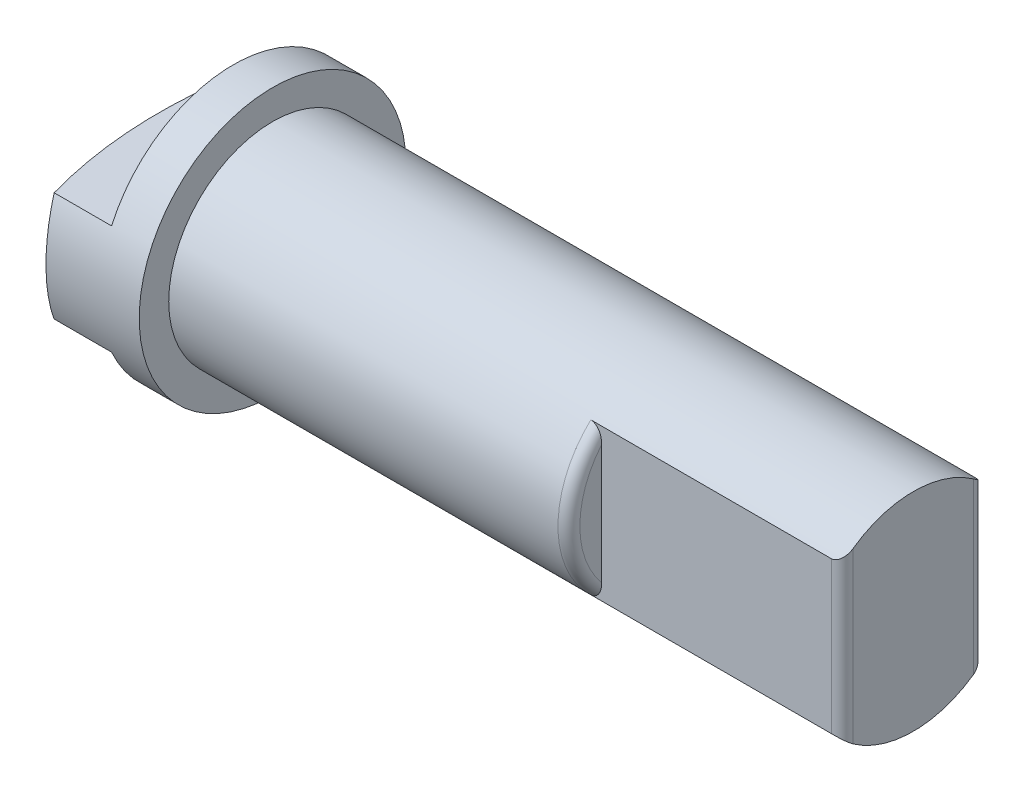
ISO-10303-21;
HEADER;
FILE_DESCRIPTION(('STEP AP214'),'2;1');
FILE_NAME('part.step','',(''),(''),'','','');
FILE_SCHEMA(('AUTOMOTIVE_DESIGN { 1 0 10303 214 1 1 1 1 }'));
ENDSEC;
DATA;
#1=APPLICATION_CONTEXT('core data for automotive mechanical design processes');
#2=APPLICATION_PROTOCOL_DEFINITION('international standard','automotive_design',2000,#1);
#3=PRODUCT_CONTEXT('',#1,'mechanical');
#4=PRODUCT('Part','Part','',(#3));
#5=PRODUCT_RELATED_PRODUCT_CATEGORY('part','',(#4));
#6=PRODUCT_DEFINITION_FORMATION('','',#4);
#7=PRODUCT_DEFINITION_CONTEXT('part definition',#1,'design');
#8=PRODUCT_DEFINITION('design','',#6,#7);
#9=PRODUCT_DEFINITION_SHAPE('','',#8);
#10=(LENGTH_UNIT() NAMED_UNIT(*) SI_UNIT(.MILLI.,.METRE.));
#11=(NAMED_UNIT(*) PLANE_ANGLE_UNIT() SI_UNIT($,.RADIAN.));
#12=(NAMED_UNIT(*) SI_UNIT($,.STERADIAN.) SOLID_ANGLE_UNIT());
#13=UNCERTAINTY_MEASURE_WITH_UNIT(LENGTH_MEASURE(1.E-05),#10,'distance_accuracy_value','');
#14=(GEOMETRIC_REPRESENTATION_CONTEXT(3) GLOBAL_UNCERTAINTY_ASSIGNED_CONTEXT((#13)) GLOBAL_UNIT_ASSIGNED_CONTEXT((#10,
#11,#12)) REPRESENTATION_CONTEXT('',''));
#15=CARTESIAN_POINT('',(0.,0.,0.));
#16=DIRECTION('',(0.,0.,1.));
#17=DIRECTION('',(1.,0.,0.));
#18=AXIS2_PLACEMENT_3D('',#15,#16,#17);
#19=CARTESIAN_POINT('',(3.39999999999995,-2.5,-10.5));
#20=DIRECTION('',(1.,0.,0.));
#21=DIRECTION('',(0.,0.,-1.));
#22=AXIS2_PLACEMENT_3D('',#19,#20,#21);
#23=PLANE('',#22);
#24=DIRECTION('',(0.,0.,1.));
#25=VECTOR('',#24,1.);
#26=CARTESIAN_POINT('',(3.39999999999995,-2.5,-10.5));
#27=LINE('',#26,#25);
#28=CARTESIAN_POINT('',(3.39999999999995,-2.5,5.56417109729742));
#29=VERTEX_POINT('',#28);
#30=CARTESIAN_POINT('',(3.39999999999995,-2.5,-5.56417109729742));
#31=VERTEX_POINT('',#30);
#32=EDGE_CURVE('E78',#29,#31,#27,.F.);
#33=ORIENTED_EDGE('',*,*,#32,.T.);
#34=CARTESIAN_POINT('',(3.39999999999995,0.,0.));
#35=DIRECTION('',(1.,0.,0.));
#36=DIRECTION('',(0.,0.,-1.));
#37=AXIS2_PLACEMENT_3D('',#34,#35,#36);
#38=CIRCLE('',#37,6.1);
#39=EDGE_CURVE('E92',#29,#31,#38,.T.);
#40=ORIENTED_EDGE('',*,*,#39,.F.);
#41=EDGE_LOOP('',(#33,#40));
#42=FACE_BOUND('',#41,.T.);
#43=ADVANCED_FACE('F17',(#42),#23,.F.);
#44=CARTESIAN_POINT('',(-5.40740411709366,-2.5,-10.5));
#45=DIRECTION('',(0.,1.,0.));
#46=DIRECTION('',(0.,0.,1.));
#47=AXIS2_PLACEMENT_3D('',#44,#45,#46);
#48=PLANE('',#47);
#49=DIRECTION('',(1.,0.,0.));
#50=VECTOR('',#49,1.);
#51=CARTESIAN_POINT('',(-20.5727236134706,-2.5,-5.56417109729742));
#52=LINE('',#51,#50);
#53=CARTESIAN_POINT('',(0.77615651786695,-2.5,-5.56417109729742));
#54=VERTEX_POINT('',#53);
#55=EDGE_CURVE('E71',#31,#54,#52,.F.);
#56=ORIENTED_EDGE('',*,*,#55,.F.);
#57=ORIENTED_EDGE('',*,*,#32,.F.);
#58=DIRECTION('',(1.,0.,0.));
#59=VECTOR('',#58,1.);
#60=CARTESIAN_POINT('',(-20.5727236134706,-2.5,5.56417109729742));
#61=LINE('',#60,#59);
#62=CARTESIAN_POINT('',(0.776156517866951,-2.5,5.56417109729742));
#63=VERTEX_POINT('',#62);
#64=EDGE_CURVE('E74',#63,#29,#61,.T.);
#65=ORIENTED_EDGE('',*,*,#64,.F.);
#66=CARTESIAN_POINT('',(20.3325091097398,-2.5,0.));
#67=DIRECTION('',(0.,-1.,0.));
#68=DIRECTION('',(0.,0.,-1.));
#69=AXIS2_PLACEMENT_3D('',#66,#67,#68);
#70=CIRCLE('',#69,20.3325091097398);
#71=EDGE_CURVE('E20',#54,#63,#70,.F.);
#72=ORIENTED_EDGE('',*,*,#71,.F.);
#73=EDGE_LOOP('',(#56,#57,#65,#72));
#74=FACE_BOUND('',#73,.T.);
#75=ADVANCED_FACE('F69',(#74),#48,.F.);
#76=CARTESIAN_POINT('',(20.3325091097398,-7.5,0.));
#77=DIRECTION('',(0.,-1.,0.));
#78=DIRECTION('',(0.,0.,-1.));
#79=AXIS2_PLACEMENT_3D('',#76,#77,#78);
#80=CYLINDRICAL_SURFACE('',#79,20.3325091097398);
#81=CARTESIAN_POINT('',(0.77615651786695,2.5,5.56417109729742));
#82=CARTESIAN_POINT('',(0.795362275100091,2.34988467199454,5.63163726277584));
#83=CARTESIAN_POINT('',(0.813207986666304,2.19687034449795,5.69306681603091));
#84=CARTESIAN_POINT('',(0.845734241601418,1.88605229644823,5.80344320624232));
#85=CARTESIAN_POINT('',(0.86041429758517,1.72824784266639,5.85238812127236));
#86=CARTESIAN_POINT('',(0.886149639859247,1.40900842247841,5.93733719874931));
#87=CARTESIAN_POINT('',(0.897207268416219,1.24757587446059,5.97334972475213));
#88=CARTESIAN_POINT('',(0.915381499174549,0.922117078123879,6.03216702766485));
#89=CARTESIAN_POINT('',(0.922498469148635,0.758091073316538,6.05497303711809));
#90=CARTESIAN_POINT('',(0.932582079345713,0.428313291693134,6.0872032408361));
#91=CARTESIAN_POINT('',(0.935541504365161,0.262559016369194,6.09660417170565));
#92=CARTESIAN_POINT('',(0.937195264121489,-0.0691853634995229,6.10186321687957));
#93=CARTESIAN_POINT('',(0.935889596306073,-0.235175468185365,6.09772132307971));
#94=CARTESIAN_POINT('',(0.929055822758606,-0.566037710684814,6.07594112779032));
#95=CARTESIAN_POINT('',(0.923531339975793,-0.730910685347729,6.05831440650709));
#96=CARTESIAN_POINT('',(0.908440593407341,-1.05844032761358,6.00975184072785));
#97=CARTESIAN_POINT('',(0.898875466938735,-1.22109760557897,5.97881974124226));
#98=CARTESIAN_POINT('',(0.873755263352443,-1.5744410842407,5.89661638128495));
#99=CARTESIAN_POINT('',(0.857397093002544,-1.76442711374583,5.84255969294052));
#100=CARTESIAN_POINT('',(0.820059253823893,-2.13765862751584,5.71658069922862));
#101=CARTESIAN_POINT('',(0.799085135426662,-2.32091190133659,5.64467983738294));
#102=CARTESIAN_POINT('',(0.776156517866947,-2.5,5.56417109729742));
#103=B_SPLINE_CURVE_WITH_KNOTS('',3,(#81,#82,#83,#84,#85,#86,#87,#88,#89,#90,#91,#92,#93,#94,
#95,#96,#97,#98,#99,#100,#101,#102),.UNSPECIFIED.,.F.,.F.,(4,2,2,2,2,2,2,2,2,2,4),(0.,
0.496965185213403,0.994006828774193,1.49072644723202,1.98739970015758,2.48493384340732,
2.98246828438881,3.47957594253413,3.9765437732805,4.57014972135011,5.16304575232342),.UNSPECIFIED.);
#104=CARTESIAN_POINT('',(0.776156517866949,2.5,5.56417109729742));
#105=VERTEX_POINT('',#104);
#106=EDGE_CURVE('E99',#105,#63,#103,.T.);
#107=ORIENTED_EDGE('',*,*,#106,.F.);
#108=CARTESIAN_POINT('',(20.3325091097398,2.5,0.));
#109=DIRECTION('',(0.,-1.,0.));
#110=DIRECTION('',(0.,0.,-1.));
#111=AXIS2_PLACEMENT_3D('',#108,#109,#110);
#112=CIRCLE('',#111,20.3325091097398);
#113=CARTESIAN_POINT('',(0.776156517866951,2.5,-5.56417109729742));
#114=VERTEX_POINT('',#113);
#115=EDGE_CURVE('E83',#105,#114,#112,.T.);
#116=ORIENTED_EDGE('',*,*,#115,.T.);
#117=CARTESIAN_POINT('',(0.776156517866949,-2.5,-5.56417109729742));
#118=CARTESIAN_POINT('',(0.795362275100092,-2.34988467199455,-5.63163726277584));
#119=CARTESIAN_POINT('',(0.813207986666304,-2.19687034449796,-5.69306681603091));
#120=CARTESIAN_POINT('',(0.845734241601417,-1.88605229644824,-5.80344320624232));
#121=CARTESIAN_POINT('',(0.860414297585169,-1.72824784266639,-5.85238812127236));
#122=CARTESIAN_POINT('',(0.886149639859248,-1.40900842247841,-5.93733719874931));
#123=CARTESIAN_POINT('',(0.897207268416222,-1.24757587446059,-5.97334972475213));
#124=CARTESIAN_POINT('',(0.915381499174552,-0.922117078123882,-6.03216702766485));
#125=CARTESIAN_POINT('',(0.922498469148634,-0.758091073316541,-6.05497303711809));
#126=CARTESIAN_POINT('',(0.932582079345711,-0.428313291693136,-6.0872032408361));
#127=CARTESIAN_POINT('',(0.935541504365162,-0.262559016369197,-6.09660417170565));
#128=CARTESIAN_POINT('',(0.93719526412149,0.06918536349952,-6.10186321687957));
#129=CARTESIAN_POINT('',(0.935889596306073,0.235175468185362,-6.09772132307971));
#130=CARTESIAN_POINT('',(0.929055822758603,0.56603771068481,-6.07594112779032));
#131=CARTESIAN_POINT('',(0.923531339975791,0.730910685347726,-6.05831440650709));
#132=CARTESIAN_POINT('',(0.908440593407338,1.05844032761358,-6.00975184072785));
#133=CARTESIAN_POINT('',(0.898875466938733,1.22109760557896,-5.97881974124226));
#134=CARTESIAN_POINT('',(0.873755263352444,1.5744410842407,-5.89661638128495));
#135=CARTESIAN_POINT('',(0.857397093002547,1.76442711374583,-5.84255969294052));
#136=CARTESIAN_POINT('',(0.820059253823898,2.13765862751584,-5.71658069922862));
#137=CARTESIAN_POINT('',(0.799085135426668,2.32091190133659,-5.64467983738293));
#138=CARTESIAN_POINT('',(0.776156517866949,2.5,-5.56417109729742));
#139=B_SPLINE_CURVE_WITH_KNOTS('',3,(#117,#118,#119,#120,#121,#122,#123,#124,#125,#126,#127,
#128,#129,#130,#131,#132,#133,#134,#135,#136,#137,#138),.UNSPECIFIED.,.F.,.F.,(4,2,2,2,2,2,2,2,
2,2,4),(0.,0.496965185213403,0.994006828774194,1.49072644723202,1.98739970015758,
2.48493384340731,2.98246828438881,3.47957594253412,3.9765437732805,4.57014972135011,
5.16304575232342),.UNSPECIFIED.);
#140=EDGE_CURVE('E80',#54,#114,#139,.T.);
#141=ORIENTED_EDGE('',*,*,#140,.F.);
#142=ORIENTED_EDGE('',*,*,#71,.T.);
#143=EDGE_LOOP('',(#107,#116,#141,#142));
#144=FACE_BOUND('',#143,.T.);
#145=ADVANCED_FACE('F81',(#144),#80,.T.);
#146=CARTESIAN_POINT('',(3.39999999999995,6.87880724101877,-10.5));
#147=DIRECTION('',(1.,0.,0.));
#148=DIRECTION('',(0.,0.,-1.));
#149=AXIS2_PLACEMENT_3D('',#146,#147,#148);
#150=PLANE('',#149);
#151=DIRECTION('',(0.,0.,-1.));
#152=VECTOR('',#151,1.);
#153=CARTESIAN_POINT('',(3.39999999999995,2.5,-10.5));
#154=LINE('',#153,#152);
#155=CARTESIAN_POINT('',(3.39999999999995,2.5,-5.56417109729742));
#156=VERTEX_POINT('',#155);
#157=CARTESIAN_POINT('',(3.39999999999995,2.5,5.56417109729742));
#158=VERTEX_POINT('',#157);
#159=EDGE_CURVE('E77',#156,#158,#154,.F.);
#160=ORIENTED_EDGE('',*,*,#159,.T.);
#161=CARTESIAN_POINT('',(3.39999999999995,0.,0.));
#162=DIRECTION('',(1.,0.,0.));
#163=DIRECTION('',(0.,0.,-1.));
#164=AXIS2_PLACEMENT_3D('',#161,#162,#163);
#165=CIRCLE('',#164,6.1);
#166=EDGE_CURVE('E206',#156,#158,#165,.T.);
#167=ORIENTED_EDGE('',*,*,#166,.F.);
#168=EDGE_LOOP('',(#160,#167));
#169=FACE_BOUND('',#168,.T.);
#170=ADVANCED_FACE('F277',(#169),#150,.F.);
#171=CARTESIAN_POINT('',(-5.94799760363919,2.5,-10.5));
#172=DIRECTION('',(0.,-1.,0.));
#173=DIRECTION('',(0.,0.,-1.));
#174=AXIS2_PLACEMENT_3D('',#171,#172,#173);
#175=PLANE('',#174);
#176=DIRECTION('',(1.,0.,0.));
#177=VECTOR('',#176,1.);
#178=CARTESIAN_POINT('',(-20.5727236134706,2.5,5.56417109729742));
#179=LINE('',#178,#177);
#180=EDGE_CURVE('E205',#158,#105,#179,.F.);
#181=ORIENTED_EDGE('',*,*,#180,.F.);
#182=ORIENTED_EDGE('',*,*,#159,.F.);
#183=DIRECTION('',(1.,0.,0.));
#184=VECTOR('',#183,1.);
#185=CARTESIAN_POINT('',(-20.5727236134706,2.5,-5.56417109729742));
#186=LINE('',#185,#184);
#187=EDGE_CURVE('E87',#114,#156,#186,.T.);
#188=ORIENTED_EDGE('',*,*,#187,.F.);
#189=ORIENTED_EDGE('',*,*,#115,.F.);
#190=EDGE_LOOP('',(#181,#182,#188,#189));
#191=FACE_BOUND('',#190,.T.);
#192=ADVANCED_FACE('F275',(#191),#175,.F.);
#193=CARTESIAN_POINT('',(-20.5727236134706,0.,0.));
#194=DIRECTION('',(1.,0.,0.));
#195=DIRECTION('',(0.,0.,-1.));
#196=AXIS2_PLACEMENT_3D('',#193,#194,#195);
#197=CYLINDRICAL_SURFACE('',#196,6.1);
#198=CARTESIAN_POINT('',(5.2,0.,0.));
#199=DIRECTION('',(1.,0.,0.));
#200=DIRECTION('',(0.,0.,-1.));
#201=AXIS2_PLACEMENT_3D('',#198,#199,#200);
#202=CIRCLE('',#201,6.1);
#203=CARTESIAN_POINT('',(5.2,0.,-6.1));
#204=VERTEX_POINT('',#203);
#205=EDGE_CURVE('E170',#204,#204,#202,.T.);
#206=ORIENTED_EDGE('',*,*,#205,.F.);
#207=EDGE_LOOP('',(#206));
#208=FACE_BOUND('',#207,.T.);
#209=ORIENTED_EDGE('',*,*,#166,.T.);
#210=ORIENTED_EDGE('',*,*,#180,.T.);
#211=ORIENTED_EDGE('',*,*,#106,.T.);
#212=ORIENTED_EDGE('',*,*,#64,.T.);
#213=ORIENTED_EDGE('',*,*,#39,.T.);
#214=ORIENTED_EDGE('',*,*,#55,.T.);
#215=ORIENTED_EDGE('',*,*,#140,.T.);
#216=ORIENTED_EDGE('',*,*,#187,.T.);
#217=EDGE_LOOP('',(#209,#210,#211,#212,#213,#214,#215,#216));
#218=FACE_BOUND('',#217,.T.);
#219=ADVANCED_FACE('F90',(#208,#218),#197,.T.);
#220=CARTESIAN_POINT('',(23.5,-6.43089834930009,-3.25));
#221=DIRECTION('',(1.,0.,0.));
#222=DIRECTION('',(0.,0.,-1.));
#223=AXIS2_PLACEMENT_3D('',#220,#221,#222);
#224=PLANE('',#223);
#225=DIRECTION('',(0.,-1.,0.));
#226=VECTOR('',#225,1.);
#227=CARTESIAN_POINT('',(23.5,5.14669437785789,-3.25));
#228=LINE('',#227,#226);
#229=CARTESIAN_POINT('',(23.5,2.73861278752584,-3.25));
#230=VERTEX_POINT('',#229);
#231=CARTESIAN_POINT('',(23.5,-2.73861278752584,-3.25));
#232=VERTEX_POINT('',#231);
#233=EDGE_CURVE('E147',#230,#232,#228,.T.);
#234=ORIENTED_EDGE('',*,*,#233,.T.);
#235=CARTESIAN_POINT('',(23.5,0.,0.));
#236=DIRECTION('',(-1.,0.,0.));
#237=DIRECTION('',(0.,0.644379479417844,-0.76470588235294));
#238=AXIS2_PLACEMENT_3D('',#235,#236,#237);
#239=CIRCLE('',#238,4.25000000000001);
#240=EDGE_CURVE('E173',#230,#232,#239,.T.);
#241=ORIENTED_EDGE('',*,*,#240,.F.);
#242=EDGE_LOOP('',(#234,#241));
#243=FACE_BOUND('',#242,.T.);
#244=ADVANCED_FACE('F216',(#243),#224,.T.);
#245=CARTESIAN_POINT('',(23.5,-6.43089834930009,3.25));
#246=DIRECTION('',(-1.,0.,0.));
#247=DIRECTION('',(0.,0.,1.));
#248=AXIS2_PLACEMENT_3D('',#245,#246,#247);
#249=PLANE('',#248);
#250=CARTESIAN_POINT('',(23.5,0.,0.));
#251=DIRECTION('',(-1.,0.,0.));
#252=DIRECTION('',(0.,-0.644379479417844,0.76470588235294));
#253=AXIS2_PLACEMENT_3D('',#250,#251,#252);
#254=CIRCLE('',#253,4.25000000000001);
#255=CARTESIAN_POINT('',(23.5,-2.73861278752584,3.25));
#256=VERTEX_POINT('',#255);
#257=CARTESIAN_POINT('',(23.5,2.73861278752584,3.25));
#258=VERTEX_POINT('',#257);
#259=EDGE_CURVE('E236',#256,#258,#254,.T.);
#260=ORIENTED_EDGE('',*,*,#259,.F.);
#261=DIRECTION('',(0.,1.,0.));
#262=VECTOR('',#261,1.);
#263=CARTESIAN_POINT('',(23.5,5.14669437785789,3.25));
#264=LINE('',#263,#262);
#265=EDGE_CURVE('E116',#256,#258,#264,.T.);
#266=ORIENTED_EDGE('',*,*,#265,.T.);
#267=EDGE_LOOP('',(#260,#266));
#268=FACE_BOUND('',#267,.T.);
#269=ADVANCED_FACE('F211',(#268),#249,.F.);
#270=CARTESIAN_POINT('',(34.,5.14669437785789,-2.75));
#271=DIRECTION('',(0.,-1.,0.));
#272=DIRECTION('',(0.,0.,-1.));
#273=AXIS2_PLACEMENT_3D('',#270,#271,#272);
#274=CYLINDRICAL_SURFACE('',#273,0.5);
#275=CARTESIAN_POINT('',(34.5,-3.87298334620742,-2.75));
#276=CARTESIAN_POINT('',(34.4999700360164,-3.84850608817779,-2.78450855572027));
#277=CARTESIAN_POINT('',(34.496427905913,-3.82354330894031,-2.81865402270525));
#278=CARTESIAN_POINT('',(34.4824854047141,-3.77324737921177,-2.88562249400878));
#279=CARTESIAN_POINT('',(34.4720364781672,-3.74791285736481,-2.91843437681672));
#280=CARTESIAN_POINT('',(34.4442930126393,-3.69755434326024,-2.98199092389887));
#281=CARTESIAN_POINT('',(34.4269206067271,-3.67253734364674,-3.01270725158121));
#282=CARTESIAN_POINT('',(34.3853226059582,-3.62425858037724,-3.07061168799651));
#283=CARTESIAN_POINT('',(34.3611186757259,-3.60099155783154,-3.0978105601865));
#284=CARTESIAN_POINT('',(34.3154084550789,-3.56530484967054,-3.13872052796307));
#285=CARTESIAN_POINT('',(34.2958940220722,-3.55192780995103,-3.15383169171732));
#286=CARTESIAN_POINT('',(34.2539331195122,-3.52721385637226,-3.18144677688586));
#287=CARTESIAN_POINT('',(34.231490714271,-3.51587416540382,-3.19395425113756));
#288=CARTESIAN_POINT('',(34.1882907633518,-3.49783983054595,-3.21368358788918));
#289=CARTESIAN_POINT('',(34.1679818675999,-3.49067449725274,-3.22145443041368));
#290=CARTESIAN_POINT('',(34.1259058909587,-3.47869639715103,-3.23438551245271));
#291=CARTESIAN_POINT('',(34.1041420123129,-3.47387864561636,-3.23955128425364));
#292=CARTESIAN_POINT('',(34.0685124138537,-3.46834637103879,-3.24547112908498));
#293=CARTESIAN_POINT('',(34.0549285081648,-3.46676257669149,-3.24716204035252));
#294=CARTESIAN_POINT('',(34.027566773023,-3.46463695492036,-3.24942941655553));
#295=CARTESIAN_POINT('',(34.0137886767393,-3.46409673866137,-3.2500041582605));
#296=CARTESIAN_POINT('',(34.,-3.46410161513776,-3.25));
#297=B_SPLINE_CURVE_WITH_KNOTS('',3,(#275,#276,#277,#278,#279,#280,#281,#282,#283,#284,#285,
#286,#287,#288,#289,#290,#291,#292,#293,#294,#295,#296),.UNSPECIFIED.,.F.,.F.,(4,2,2,2,2,2,2,2,
2,2,4),(0.,0.126762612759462,0.254425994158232,0.383567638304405,0.512304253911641,
0.596245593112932,0.680071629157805,0.748488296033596,0.816759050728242,0.858019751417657,
0.899344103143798),.UNSPECIFIED.);
#298=CARTESIAN_POINT('',(34.5,-3.87298334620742,-2.75));
#299=VERTEX_POINT('',#298);
#300=CARTESIAN_POINT('',(34.,-3.46410161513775,-3.25));
#301=VERTEX_POINT('',#300);
#302=EDGE_CURVE('E195',#299,#301,#297,.T.);
#303=ORIENTED_EDGE('',*,*,#302,.T.);
#304=DIRECTION('',(0.,-1.,0.));
#305=VECTOR('',#304,1.);
#306=CARTESIAN_POINT('',(34.,5.14669437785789,-3.25));
#307=LINE('',#306,#305);
#308=CARTESIAN_POINT('',(34.,3.46410161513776,-3.25));
#309=VERTEX_POINT('',#308);
#310=EDGE_CURVE('E146',#301,#309,#307,.F.);
#311=ORIENTED_EDGE('',*,*,#310,.T.);
#312=CARTESIAN_POINT('',(34.,3.46410161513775,-3.25));
#313=CARTESIAN_POINT('',(34.0231217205,3.46405946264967,-3.25003745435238));
#314=CARTESIAN_POINT('',(34.0461819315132,3.46560394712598,-3.24839895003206));
#315=CARTESIAN_POINT('',(34.0913185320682,3.47149818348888,-3.24210286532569));
#316=CARTESIAN_POINT('',(34.1134017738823,3.47582322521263,-3.23747187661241));
#317=CARTESIAN_POINT('',(34.1560896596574,3.48690577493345,-3.22553090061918));
#318=CARTESIAN_POINT('',(34.1766984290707,3.49365615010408,-3.21822876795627));
#319=CARTESIAN_POINT('',(34.2162061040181,3.50912915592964,-3.20135050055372));
#320=CARTESIAN_POINT('',(34.2351008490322,3.51785641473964,-3.19176902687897));
#321=CARTESIAN_POINT('',(34.2781913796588,3.54065806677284,-3.16648575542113));
#322=CARTESIAN_POINT('',(34.3014616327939,3.55547112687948,-3.14987248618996));
#323=CARTESIAN_POINT('',(34.3441265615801,3.58709431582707,-3.11381324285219));
#324=CARTESIAN_POINT('',(34.3635138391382,3.60390816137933,-3.09436198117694));
#325=CARTESIAN_POINT('',(34.4031261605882,3.64346647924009,-3.04775581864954));
#326=CARTESIAN_POINT('',(34.4221838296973,3.66659290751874,-3.01993324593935));
#327=CARTESIAN_POINT('',(34.4541811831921,3.71377920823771,-2.96171430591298));
#328=CARTESIAN_POINT('',(34.4671194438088,3.73783929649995,-2.93131734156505));
#329=CARTESIAN_POINT('',(34.484571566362,3.78061237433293,-2.8758305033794));
#330=CARTESIAN_POINT('',(34.4903315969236,3.79929821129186,-2.85110399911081));
#331=CARTESIAN_POINT('',(34.4980353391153,3.8364007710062,-2.80098419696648));
#332=CARTESIAN_POINT('',(34.499990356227,3.85481812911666,-2.7755931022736));
#333=CARTESIAN_POINT('',(34.5,3.87298334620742,-2.75));
#334=B_SPLINE_CURVE_WITH_KNOTS('',3,(#312,#313,#314,#315,#316,#317,#318,#319,#320,#321,#322,
#323,#324,#325,#326,#327,#328,#329,#330,#331,#332,#333),.UNSPECIFIED.,.F.,.F.,(4,2,2,2,2,2,2,2,
2,2,4),(0.,0.069158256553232,0.137710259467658,0.206062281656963,0.27457601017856,
0.370653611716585,0.466912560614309,0.588963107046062,0.711042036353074,0.805383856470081,
0.899444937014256),.UNSPECIFIED.);
#335=CARTESIAN_POINT('',(34.5,3.87298334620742,-2.75));
#336=VERTEX_POINT('',#335);
#337=EDGE_CURVE('E35',#309,#336,#334,.T.);
#338=ORIENTED_EDGE('',*,*,#337,.T.);
#339=DIRECTION('',(0.,1.,0.));
#340=VECTOR('',#339,1.);
#341=CARTESIAN_POINT('',(34.5,-4.75,-2.75));
#342=LINE('',#341,#340);
#343=EDGE_CURVE('E332',#299,#336,#342,.T.);
#344=ORIENTED_EDGE('',*,*,#343,.F.);
#345=EDGE_LOOP('',(#303,#311,#338,#344));
#346=FACE_BOUND('',#345,.T.);
#347=ADVANCED_FACE('F207',(#346),#274,.T.);
#348=CARTESIAN_POINT('',(34.,5.14669437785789,2.75));
#349=DIRECTION('',(0.,1.,0.));
#350=DIRECTION('',(0.,0.,1.));
#351=AXIS2_PLACEMENT_3D('',#348,#349,#350);
#352=CYLINDRICAL_SURFACE('',#351,0.5);
#353=CARTESIAN_POINT('',(34.5,3.87298334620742,2.75));
#354=CARTESIAN_POINT('',(34.4999700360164,3.84850608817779,2.78450855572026));
#355=CARTESIAN_POINT('',(34.496427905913,3.82354330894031,2.81865402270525));
#356=CARTESIAN_POINT('',(34.4824854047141,3.77324737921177,2.88562249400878));
#357=CARTESIAN_POINT('',(34.4720364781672,3.74791285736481,2.91843437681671));
#358=CARTESIAN_POINT('',(34.4442930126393,3.69755434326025,2.98199092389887));
#359=CARTESIAN_POINT('',(34.4269206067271,3.67253734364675,3.01270725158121));
#360=CARTESIAN_POINT('',(34.3853226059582,3.62425858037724,3.0706116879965));
#361=CARTESIAN_POINT('',(34.3611186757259,3.60099155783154,3.09781056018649));
#362=CARTESIAN_POINT('',(34.3154084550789,3.56530484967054,3.13872052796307));
#363=CARTESIAN_POINT('',(34.2958940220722,3.55192780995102,3.15383169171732));
#364=CARTESIAN_POINT('',(34.2539331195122,3.52721385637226,3.18144677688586));
#365=CARTESIAN_POINT('',(34.231490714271,3.51587416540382,3.19395425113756));
#366=CARTESIAN_POINT('',(34.1882907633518,3.49783983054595,3.21368358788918));
#367=CARTESIAN_POINT('',(34.1679818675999,3.49067449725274,3.22145443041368));
#368=CARTESIAN_POINT('',(34.1259058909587,3.47869639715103,3.23438551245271));
#369=CARTESIAN_POINT('',(34.1041420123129,3.47387864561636,3.23955128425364));
#370=CARTESIAN_POINT('',(34.0685124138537,3.46834637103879,3.24547112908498));
#371=CARTESIAN_POINT('',(34.0549285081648,3.46676257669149,3.24716204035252));
#372=CARTESIAN_POINT('',(34.027566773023,3.46463695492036,3.24942941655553));
#373=CARTESIAN_POINT('',(34.0137886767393,3.46409673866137,3.2500041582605));
#374=CARTESIAN_POINT('',(34.,3.46410161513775,3.25));
#375=B_SPLINE_CURVE_WITH_KNOTS('',3,(#353,#354,#355,#356,#357,#358,#359,#360,#361,#362,#363,
#364,#365,#366,#367,#368,#369,#370,#371,#372,#373,#374),.UNSPECIFIED.,.F.,.F.,(4,2,2,2,2,2,2,2,
2,2,4),(0.,0.126762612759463,0.254425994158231,0.383567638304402,0.512304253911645,
0.596245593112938,0.680071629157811,0.748488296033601,0.816759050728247,0.85801975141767,
0.899344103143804),.UNSPECIFIED.);
#376=CARTESIAN_POINT('',(34.5,3.87298334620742,2.75));
#377=VERTEX_POINT('',#376);
#378=CARTESIAN_POINT('',(34.,3.46410161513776,3.25));
#379=VERTEX_POINT('',#378);
#380=EDGE_CURVE('E174',#377,#379,#375,.T.);
#381=ORIENTED_EDGE('',*,*,#380,.T.);
#382=DIRECTION('',(0.,1.,0.));
#383=VECTOR('',#382,1.);
#384=CARTESIAN_POINT('',(34.,5.14669437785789,3.25));
#385=LINE('',#384,#383);
#386=CARTESIAN_POINT('',(34.,-3.46410161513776,3.25));
#387=VERTEX_POINT('',#386);
#388=EDGE_CURVE('E115',#379,#387,#385,.F.);
#389=ORIENTED_EDGE('',*,*,#388,.T.);
#390=CARTESIAN_POINT('',(34.,-3.46410161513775,3.25));
#391=CARTESIAN_POINT('',(34.0231217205,-3.46405946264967,3.25003745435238));
#392=CARTESIAN_POINT('',(34.0461819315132,-3.46560394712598,3.24839895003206));
#393=CARTESIAN_POINT('',(34.0913185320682,-3.47149818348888,3.24210286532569));
#394=CARTESIAN_POINT('',(34.1134017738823,-3.47582322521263,3.23747187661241));
#395=CARTESIAN_POINT('',(34.1560896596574,-3.48690577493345,3.22553090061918));
#396=CARTESIAN_POINT('',(34.1766984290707,-3.49365615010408,3.21822876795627));
#397=CARTESIAN_POINT('',(34.2162061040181,-3.50912915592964,3.20135050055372));
#398=CARTESIAN_POINT('',(34.2351008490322,-3.51785641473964,3.19176902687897));
#399=CARTESIAN_POINT('',(34.2781913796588,-3.54065806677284,3.16648575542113));
#400=CARTESIAN_POINT('',(34.3014616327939,-3.55547112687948,3.14987248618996));
#401=CARTESIAN_POINT('',(34.3441265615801,-3.58709431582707,3.11381324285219));
#402=CARTESIAN_POINT('',(34.3635138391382,-3.60390816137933,3.09436198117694));
#403=CARTESIAN_POINT('',(34.4031261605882,-3.64346647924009,3.04775581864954));
#404=CARTESIAN_POINT('',(34.4221838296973,-3.66659290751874,3.01993324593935));
#405=CARTESIAN_POINT('',(34.4541811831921,-3.71377920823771,2.96171430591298));
#406=CARTESIAN_POINT('',(34.4671194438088,-3.73783929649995,2.93131734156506));
#407=CARTESIAN_POINT('',(34.484571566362,-3.78061237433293,2.87583050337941));
#408=CARTESIAN_POINT('',(34.4903315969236,-3.79929821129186,2.85110399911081));
#409=CARTESIAN_POINT('',(34.4980353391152,-3.8364007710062,2.80098419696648));
#410=CARTESIAN_POINT('',(34.499990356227,-3.85481812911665,2.7755931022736));
#411=CARTESIAN_POINT('',(34.5,-3.87298334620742,2.75));
#412=B_SPLINE_CURVE_WITH_KNOTS('',3,(#390,#391,#392,#393,#394,#395,#396,#397,#398,#399,#400,
#401,#402,#403,#404,#405,#406,#407,#408,#409,#410,#411),.UNSPECIFIED.,.F.,.F.,(4,2,2,2,2,2,2,2,
2,2,4),(0.,0.069158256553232,0.137710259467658,0.206062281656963,0.27457601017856,
0.370653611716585,0.466912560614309,0.58896310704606,0.71104203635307,0.805383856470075,
0.89944493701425),.UNSPECIFIED.);
#413=CARTESIAN_POINT('',(34.5,-3.87298334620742,2.75));
#414=VERTEX_POINT('',#413);
#415=EDGE_CURVE('E181',#387,#414,#412,.T.);
#416=ORIENTED_EDGE('',*,*,#415,.T.);
#417=DIRECTION('',(0.,1.,0.));
#418=VECTOR('',#417,1.);
#419=CARTESIAN_POINT('',(34.5,-4.75,2.75));
#420=LINE('',#419,#418);
#421=EDGE_CURVE('E111',#377,#414,#420,.F.);
#422=ORIENTED_EDGE('',*,*,#421,.F.);
#423=EDGE_LOOP('',(#381,#389,#416,#422));
#424=FACE_BOUND('',#423,.T.);
#425=ADVANCED_FACE('F186',(#424),#352,.T.);
#426=CARTESIAN_POINT('',(5.2,-6.1,0.));
#427=DIRECTION('',(1.,0.,0.));
#428=DIRECTION('',(0.,0.,-1.));
#429=AXIS2_PLACEMENT_3D('',#426,#427,#428);
#430=PLANE('',#429);
#431=CARTESIAN_POINT('',(5.2,0.,0.));
#432=DIRECTION('',(1.,0.,0.));
#433=DIRECTION('',(0.,0.,-1.));
#434=AXIS2_PLACEMENT_3D('',#431,#432,#433);
#435=CIRCLE('',#434,4.75);
#436=CARTESIAN_POINT('',(5.2,0.,-4.75));
#437=VERTEX_POINT('',#436);
#438=EDGE_CURVE('E107',#437,#437,#435,.T.);
#439=ORIENTED_EDGE('',*,*,#438,.F.);
#440=EDGE_LOOP('',(#439));
#441=FACE_BOUND('',#440,.T.);
#442=ORIENTED_EDGE('',*,*,#205,.T.);
#443=EDGE_LOOP('',(#442));
#444=FACE_BOUND('',#443,.T.);
#445=ADVANCED_FACE('F305',(#441,#444),#430,.T.);
#446=CARTESIAN_POINT('',(23.,0.,0.));
#447=DIRECTION('',(1.,0.,0.));
#448=DIRECTION('',(0.,0.,-1.));
#449=AXIS2_PLACEMENT_3D('',#446,#447,#448);
#450=TOROIDAL_SURFACE('',#449,4.25,0.5);
#451=ORIENTED_EDGE('',*,*,#240,.T.);
#452=CARTESIAN_POINT('',(23.5,-2.73861278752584,-3.25));
#453=CARTESIAN_POINT('',(23.4999933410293,-2.76884825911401,-3.25));
#454=CARTESIAN_POINT('',(23.4988603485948,-2.79909977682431,-3.25));
#455=CARTESIAN_POINT('',(23.4941545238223,-2.85949897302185,-3.25));
#456=CARTESIAN_POINT('',(23.4905745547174,-2.88964608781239,-3.25));
#457=CARTESIAN_POINT('',(23.4807234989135,-2.94990004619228,-3.25));
#458=CARTESIAN_POINT('',(23.4744188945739,-2.98000154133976,-3.25));
#459=CARTESIAN_POINT('',(23.4588877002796,-3.03940932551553,-3.25));
#460=CARTESIAN_POINT('',(23.4496647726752,-3.06871656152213,-3.25));
#461=CARTESIAN_POINT('',(23.4264902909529,-3.13023930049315,-3.25));
#462=CARTESIAN_POINT('',(23.4120528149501,-3.16227572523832,-3.25));
#463=CARTESIAN_POINT('',(23.3786599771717,-3.22379955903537,-3.25));
#464=CARTESIAN_POINT('',(23.3597224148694,-3.25329640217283,-3.25));
#465=CARTESIAN_POINT('',(23.3212426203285,-3.303081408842,-3.25));
#466=CARTESIAN_POINT('',(23.3025669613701,-3.32403514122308,-3.25));
#467=CARTESIAN_POINT('',(23.2620900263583,-3.3626455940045,-3.25));
#468=CARTESIAN_POINT('',(23.2402957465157,-3.38030949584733,-3.25));
#469=CARTESIAN_POINT('',(23.1982033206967,-3.40838747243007,-3.25));
#470=CARTESIAN_POINT('',(23.1783994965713,-3.41954067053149,-3.25));
#471=CARTESIAN_POINT('',(23.1372293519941,-3.43840252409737,-3.25));
#472=CARTESIAN_POINT('',(23.1158661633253,-3.4461178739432,-3.25));
#473=CARTESIAN_POINT('',(23.0786880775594,-3.45589202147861,-3.25));
#474=CARTESIAN_POINT('',(23.0631320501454,-3.45895349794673,-3.25));
#475=CARTESIAN_POINT('',(23.0317223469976,-3.46306588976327,-3.25));
#476=CARTESIAN_POINT('',(23.0158680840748,-3.46411229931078,-3.25));
#477=CARTESIAN_POINT('',(23.,-3.46410161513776,-3.25));
#478=B_SPLINE_CURVE_WITH_KNOTS('',3,(#452,#453,#454,#455,#456,#457,#458,#459,#460,#461,#462,
#463,#464,#465,#466,#467,#468,#469,#470,#471,#472,#473,#474,#475,#476,#477),.UNSPECIFIED.,.F.,
.F.,(4,2,2,2,2,2,2,2,2,2,2,2,4),(0.,0.0907095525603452,0.18168480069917,0.273812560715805,
0.365825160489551,0.470922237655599,0.575610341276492,0.659513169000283,0.743230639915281,
0.811143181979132,0.878922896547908,0.926362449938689,0.973907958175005),.UNSPECIFIED.);
#479=CARTESIAN_POINT('',(23.,-3.46410161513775,-3.25));
#480=VERTEX_POINT('',#479);
#481=EDGE_CURVE('E143',#232,#480,#478,.T.);
#482=ORIENTED_EDGE('',*,*,#481,.T.);
#483=CARTESIAN_POINT('',(23.,0.,0.));
#484=DIRECTION('',(1.,0.,0.));
#485=DIRECTION('',(0.,0.,-1.));
#486=AXIS2_PLACEMENT_3D('',#483,#484,#485);
#487=CIRCLE('',#486,4.75);
#488=CARTESIAN_POINT('',(23.,3.46410161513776,-3.25));
#489=VERTEX_POINT('',#488);
#490=EDGE_CURVE('E342',#489,#480,#487,.F.);
#491=ORIENTED_EDGE('',*,*,#490,.F.);
#492=CARTESIAN_POINT('',(23.,3.46410161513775,-3.25));
#493=CARTESIAN_POINT('',(23.0113225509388,3.46410328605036,-3.25));
#494=CARTESIAN_POINT('',(23.0226384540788,3.46357379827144,-3.25));
#495=CARTESIAN_POINT('',(23.0451660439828,3.46147343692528,-3.25));
#496=CARTESIAN_POINT('',(23.0563777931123,3.45990323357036,-3.25));
#497=CARTESIAN_POINT('',(23.0895588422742,3.45369622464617,-3.25));
#498=CARTESIAN_POINT('',(23.1112635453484,3.44756222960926,-3.25));
#499=CARTESIAN_POINT('',(23.1532425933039,3.43172294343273,-3.25));
#500=CARTESIAN_POINT('',(23.1735198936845,3.42202530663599,-3.25));
#501=CARTESIAN_POINT('',(23.2123498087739,3.39959550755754,-3.25));
#502=CARTESIAN_POINT('',(23.2308990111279,3.38685751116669,-3.25));
#503=CARTESIAN_POINT('',(23.2722766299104,3.35395223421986,-3.25));
#504=CARTESIAN_POINT('',(23.2942838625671,3.33275334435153,-3.25));
#505=CARTESIAN_POINT('',(23.3345994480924,3.28706544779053,-3.25));
#506=CARTESIAN_POINT('',(23.3528978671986,3.26256789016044,-3.25));
#507=CARTESIAN_POINT('',(23.3922752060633,3.20139377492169,-3.25));
#508=CARTESIAN_POINT('',(23.4117082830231,3.16366184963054,-3.25));
#509=CARTESIAN_POINT('',(23.4443996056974,3.0855485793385,-3.25));
#510=CARTESIAN_POINT('',(23.4576360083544,3.0451584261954,-3.25));
#511=CARTESIAN_POINT('',(23.4791962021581,2.96056207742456,-3.25));
#512=CARTESIAN_POINT('',(23.4871806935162,2.91627183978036,-3.25));
#513=CARTESIAN_POINT('',(23.4975396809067,2.82748747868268,-3.25));
#514=CARTESIAN_POINT('',(23.4999710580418,2.78300014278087,-3.25));
#515=CARTESIAN_POINT('',(23.5,2.73861278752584,-3.25));
#516=B_SPLINE_CURVE_WITH_KNOTS('',3,(#492,#493,#494,#495,#496,#497,#498,#499,#500,#501,#502,
#503,#504,#505,#506,#507,#508,#509,#510,#511,#512,#513,#514,#515),.UNSPECIFIED.,.F.,.F.,(4,2,2,
2,2,2,2,2,2,2,2,4),(0.,0.0339425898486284,0.0678633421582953,0.135144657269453,
0.202282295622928,0.26954981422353,0.360717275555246,0.452125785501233,0.578759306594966,
0.705835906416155,0.840476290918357,0.973731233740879),.UNSPECIFIED.);
#517=EDGE_CURVE('E154',#489,#230,#516,.T.);
#518=ORIENTED_EDGE('',*,*,#517,.T.);
#519=EDGE_LOOP('',(#451,#482,#491,#518));
#520=FACE_BOUND('',#519,.T.);
#521=ADVANCED_FACE('F156',(#520),#450,.T.);
#522=CARTESIAN_POINT('',(23.5,5.14669437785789,-3.25));
#523=DIRECTION('',(0.,0.,1.));
#524=DIRECTION('',(0.,-1.,0.));
#525=AXIS2_PLACEMENT_3D('',#522,#523,#524);
#526=PLANE('',#525);
#527=ORIENTED_EDGE('',*,*,#310,.F.);
#528=DIRECTION('',(1.,0.,0.));
#529=VECTOR('',#528,1.);
#530=CARTESIAN_POINT('',(-20.5727236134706,-3.46410161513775,-3.25));
#531=LINE('',#530,#529);
#532=EDGE_CURVE('E106',#480,#301,#531,.T.);
#533=ORIENTED_EDGE('',*,*,#532,.F.);
#534=ORIENTED_EDGE('',*,*,#481,.F.);
#535=ORIENTED_EDGE('',*,*,#233,.F.);
#536=ORIENTED_EDGE('',*,*,#517,.F.);
#537=DIRECTION('',(1.,0.,0.));
#538=VECTOR('',#537,1.);
#539=CARTESIAN_POINT('',(-20.5727236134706,3.46410161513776,-3.25));
#540=LINE('',#539,#538);
#541=EDGE_CURVE('E110',#309,#489,#540,.F.);
#542=ORIENTED_EDGE('',*,*,#541,.F.);
#543=EDGE_LOOP('',(#527,#533,#534,#535,#536,#542));
#544=FACE_BOUND('',#543,.T.);
#545=ADVANCED_FACE('F160',(#544),#526,.F.);
#546=CARTESIAN_POINT('',(23.,0.,0.));
#547=DIRECTION('',(-1.,0.,0.));
#548=DIRECTION('',(0.,0.,1.));
#549=AXIS2_PLACEMENT_3D('',#546,#547,#548);
#550=TOROIDAL_SURFACE('',#549,4.25,0.5);
#551=CARTESIAN_POINT('',(23.,0.,0.));
#552=DIRECTION('',(1.,0.,0.));
#553=DIRECTION('',(0.,0.,-1.));
#554=AXIS2_PLACEMENT_3D('',#551,#552,#553);
#555=CIRCLE('',#554,4.75);
#556=CARTESIAN_POINT('',(23.,-3.46410161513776,3.25));
#557=VERTEX_POINT('',#556);
#558=CARTESIAN_POINT('',(23.,3.46410161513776,3.25));
#559=VERTEX_POINT('',#558);
#560=EDGE_CURVE('E335',#557,#559,#555,.F.);
#561=ORIENTED_EDGE('',*,*,#560,.F.);
#562=CARTESIAN_POINT('',(23.,-3.46410161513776,3.25));
#563=CARTESIAN_POINT('',(23.0113225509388,-3.46410328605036,3.25));
#564=CARTESIAN_POINT('',(23.0226384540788,-3.46357379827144,3.25));
#565=CARTESIAN_POINT('',(23.0451660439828,-3.46147343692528,3.25));
#566=CARTESIAN_POINT('',(23.0563777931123,-3.45990323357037,3.25));
#567=CARTESIAN_POINT('',(23.0895588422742,-3.45369622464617,3.25));
#568=CARTESIAN_POINT('',(23.1112635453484,-3.44756222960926,3.25));
#569=CARTESIAN_POINT('',(23.1532425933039,-3.43172294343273,3.25));
#570=CARTESIAN_POINT('',(23.1735198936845,-3.42202530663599,3.25));
#571=CARTESIAN_POINT('',(23.2123498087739,-3.39959550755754,3.25));
#572=CARTESIAN_POINT('',(23.2308990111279,-3.3868575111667,3.25));
#573=CARTESIAN_POINT('',(23.2722766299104,-3.35395223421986,3.25));
#574=CARTESIAN_POINT('',(23.2942838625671,-3.33275334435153,3.25));
#575=CARTESIAN_POINT('',(23.3345994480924,-3.28706544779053,3.25));
#576=CARTESIAN_POINT('',(23.3528978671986,-3.26256789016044,3.25));
#577=CARTESIAN_POINT('',(23.3922752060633,-3.20139377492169,3.25));
#578=CARTESIAN_POINT('',(23.4117082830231,-3.16366184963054,3.25));
#579=CARTESIAN_POINT('',(23.4443996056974,-3.08554857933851,3.25));
#580=CARTESIAN_POINT('',(23.4576360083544,-3.0451584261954,3.25));
#581=CARTESIAN_POINT('',(23.4791962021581,-2.96056207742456,3.25));
#582=CARTESIAN_POINT('',(23.4871806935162,-2.91627183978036,3.25));
#583=CARTESIAN_POINT('',(23.4975396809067,-2.82748747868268,3.25));
#584=CARTESIAN_POINT('',(23.4999710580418,-2.78300014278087,3.25));
#585=CARTESIAN_POINT('',(23.5,-2.73861278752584,3.25));
#586=B_SPLINE_CURVE_WITH_KNOTS('',3,(#562,#563,#564,#565,#566,#567,#568,#569,#570,#571,#572,
#573,#574,#575,#576,#577,#578,#579,#580,#581,#582,#583,#584,#585),.UNSPECIFIED.,.F.,.F.,(4,2,2,
2,2,2,2,2,2,2,2,4),(0.,0.0339425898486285,0.0678633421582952,0.135144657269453,
0.202282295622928,0.269549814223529,0.360717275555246,0.452125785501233,0.578759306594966,
0.705835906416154,0.840476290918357,0.97373123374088),.UNSPECIFIED.);
#587=EDGE_CURVE('E124',#557,#256,#586,.T.);
#588=ORIENTED_EDGE('',*,*,#587,.T.);
#589=ORIENTED_EDGE('',*,*,#259,.T.);
#590=CARTESIAN_POINT('',(23.5,2.73861278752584,3.25));
#591=CARTESIAN_POINT('',(23.4999933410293,2.76884825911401,3.25));
#592=CARTESIAN_POINT('',(23.4988603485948,2.79909977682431,3.25));
#593=CARTESIAN_POINT('',(23.4941545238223,2.85949897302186,3.25));
#594=CARTESIAN_POINT('',(23.4905745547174,2.88964608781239,3.25));
#595=CARTESIAN_POINT('',(23.4807234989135,2.94990004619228,3.25));
#596=CARTESIAN_POINT('',(23.4744188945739,2.98000154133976,3.25));
#597=CARTESIAN_POINT('',(23.4588877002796,3.03940932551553,3.25));
#598=CARTESIAN_POINT('',(23.4496647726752,3.06871656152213,3.25));
#599=CARTESIAN_POINT('',(23.4264902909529,3.13023930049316,3.25));
#600=CARTESIAN_POINT('',(23.4120528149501,3.16227572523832,3.25));
#601=CARTESIAN_POINT('',(23.3786599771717,3.22379955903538,3.25));
#602=CARTESIAN_POINT('',(23.3597224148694,3.25329640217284,3.25));
#603=CARTESIAN_POINT('',(23.3212426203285,3.303081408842,3.25));
#604=CARTESIAN_POINT('',(23.3025669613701,3.32403514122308,3.25));
#605=CARTESIAN_POINT('',(23.2620900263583,3.36264559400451,3.25));
#606=CARTESIAN_POINT('',(23.2402957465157,3.38030949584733,3.25));
#607=CARTESIAN_POINT('',(23.1982033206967,3.40838747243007,3.25));
#608=CARTESIAN_POINT('',(23.1783994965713,3.41954067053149,3.25));
#609=CARTESIAN_POINT('',(23.1372293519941,3.43840252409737,3.25));
#610=CARTESIAN_POINT('',(23.1158661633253,3.4461178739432,3.25));
#611=CARTESIAN_POINT('',(23.0786880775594,3.45589202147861,3.25));
#612=CARTESIAN_POINT('',(23.0631320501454,3.45895349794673,3.25));
#613=CARTESIAN_POINT('',(23.0317223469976,3.46306588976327,3.25));
#614=CARTESIAN_POINT('',(23.0158680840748,3.46411229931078,3.25));
#615=CARTESIAN_POINT('',(23.,3.46410161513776,3.25));
#616=B_SPLINE_CURVE_WITH_KNOTS('',3,(#590,#591,#592,#593,#594,#595,#596,#597,#598,#599,#600,
#601,#602,#603,#604,#605,#606,#607,#608,#609,#610,#611,#612,#613,#614,#615),.UNSPECIFIED.,.F.,
.F.,(4,2,2,2,2,2,2,2,2,2,2,2,4),(0.,0.0907095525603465,0.181684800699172,0.273812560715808,
0.365825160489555,0.470922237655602,0.575610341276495,0.659513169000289,0.743230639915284,
0.811143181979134,0.87892289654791,0.92636244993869,0.973907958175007),.UNSPECIFIED.);
#617=EDGE_CURVE('E112',#258,#559,#616,.T.);
#618=ORIENTED_EDGE('',*,*,#617,.T.);
#619=EDGE_LOOP('',(#561,#588,#589,#618));
#620=FACE_BOUND('',#619,.T.);
#621=ADVANCED_FACE('F126',(#620),#550,.T.);
#622=CARTESIAN_POINT('',(23.5,5.14669437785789,3.25));
#623=DIRECTION('',(0.,0.,-1.));
#624=DIRECTION('',(0.,1.,0.));
#625=AXIS2_PLACEMENT_3D('',#622,#623,#624);
#626=PLANE('',#625);
#627=ORIENTED_EDGE('',*,*,#388,.F.);
#628=DIRECTION('',(1.,0.,0.));
#629=VECTOR('',#628,1.);
#630=CARTESIAN_POINT('',(-20.5727236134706,3.46410161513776,3.25));
#631=LINE('',#630,#629);
#632=EDGE_CURVE('E26',#559,#379,#631,.T.);
#633=ORIENTED_EDGE('',*,*,#632,.F.);
#634=ORIENTED_EDGE('',*,*,#617,.F.);
#635=ORIENTED_EDGE('',*,*,#265,.F.);
#636=ORIENTED_EDGE('',*,*,#587,.F.);
#637=DIRECTION('',(1.,0.,0.));
#638=VECTOR('',#637,1.);
#639=CARTESIAN_POINT('',(-20.5727236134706,-3.46410161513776,3.25));
#640=LINE('',#639,#638);
#641=EDGE_CURVE('E105',#387,#557,#640,.F.);
#642=ORIENTED_EDGE('',*,*,#641,.F.);
#643=EDGE_LOOP('',(#627,#633,#634,#635,#636,#642));
#644=FACE_BOUND('',#643,.T.);
#645=ADVANCED_FACE('F130',(#644),#626,.F.);
#646=CARTESIAN_POINT('',(34.5,-4.75,0.));
#647=DIRECTION('',(1.,0.,0.));
#648=DIRECTION('',(0.,0.,-1.));
#649=AXIS2_PLACEMENT_3D('',#646,#647,#648);
#650=PLANE('',#649);
#651=CARTESIAN_POINT('',(34.5,0.,0.));
#652=DIRECTION('',(1.,0.,0.));
#653=DIRECTION('',(0.,0.,-1.));
#654=AXIS2_PLACEMENT_3D('',#651,#652,#653);
#655=CIRCLE('',#654,4.75);
#656=EDGE_CURVE('E11',#377,#336,#655,.F.);
#657=ORIENTED_EDGE('',*,*,#656,.F.);
#658=ORIENTED_EDGE('',*,*,#421,.T.);
#659=CARTESIAN_POINT('',(34.5,0.,0.));
#660=DIRECTION('',(1.,0.,0.));
#661=DIRECTION('',(0.,0.,-1.));
#662=AXIS2_PLACEMENT_3D('',#659,#660,#661);
#663=CIRCLE('',#662,4.75);
#664=EDGE_CURVE('E102',#299,#414,#663,.F.);
#665=ORIENTED_EDGE('',*,*,#664,.F.);
#666=ORIENTED_EDGE('',*,*,#343,.T.);
#667=EDGE_LOOP('',(#657,#658,#665,#666));
#668=FACE_BOUND('',#667,.T.);
#669=ADVANCED_FACE('F134',(#668),#650,.T.);
#670=CARTESIAN_POINT('',(-20.5727236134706,0.,0.));
#671=DIRECTION('',(1.,0.,0.));
#672=DIRECTION('',(0.,0.,-1.));
#673=AXIS2_PLACEMENT_3D('',#670,#671,#672);
#674=CYLINDRICAL_SURFACE('',#673,4.75);
#675=ORIENTED_EDGE('',*,*,#656,.T.);
#676=ORIENTED_EDGE('',*,*,#337,.F.);
#677=ORIENTED_EDGE('',*,*,#541,.T.);
#678=ORIENTED_EDGE('',*,*,#490,.T.);
#679=ORIENTED_EDGE('',*,*,#532,.T.);
#680=ORIENTED_EDGE('',*,*,#302,.F.);
#681=ORIENTED_EDGE('',*,*,#664,.T.);
#682=ORIENTED_EDGE('',*,*,#415,.F.);
#683=ORIENTED_EDGE('',*,*,#641,.T.);
#684=ORIENTED_EDGE('',*,*,#560,.T.);
#685=ORIENTED_EDGE('',*,*,#632,.T.);
#686=ORIENTED_EDGE('',*,*,#380,.F.);
#687=EDGE_LOOP('',(#675,#676,#677,#678,#679,#680,#681,#682,#683,#684,#685,#686));
#688=FACE_BOUND('',#687,.T.);
#689=ORIENTED_EDGE('',*,*,#438,.T.);
#690=EDGE_LOOP('',(#689));
#691=FACE_BOUND('',#690,.T.);
#692=ADVANCED_FACE('F189',(#688,#691),#674,.T.);
#693=CLOSED_SHELL('',(#43,#75,#145,#170,#192,#219,#244,#269,#347,#425,#445,#521,#545,#621,#645,
#669,#692));
#694=MANIFOLD_SOLID_BREP('B1',#693);
#695=ADVANCED_BREP_SHAPE_REPRESENTATION('',(#18,#694),#14);
#696=SHAPE_DEFINITION_REPRESENTATION(#9,#695);
ENDSEC;
END-ISO-10303-21;
